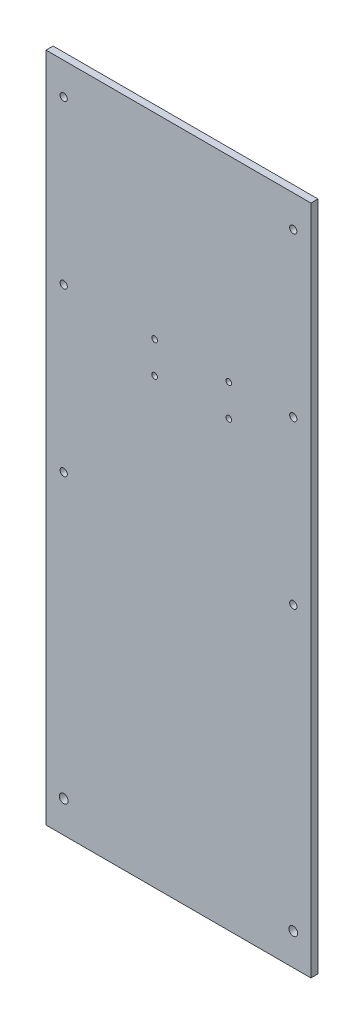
ISO-10303-21;
HEADER;
FILE_DESCRIPTION(('STEP AP214'),'2;1');
FILE_NAME('part.step','',(''),(''),'','','');
FILE_SCHEMA(('AUTOMOTIVE_DESIGN { 1 0 10303 214 1 1 1 1 }'));
ENDSEC;
DATA;
#1=APPLICATION_CONTEXT('core data for automotive mechanical design processes');
#2=APPLICATION_PROTOCOL_DEFINITION('international standard','automotive_design',2000,#1);
#3=PRODUCT_CONTEXT('',#1,'mechanical');
#4=PRODUCT('Part','Part','',(#3));
#5=PRODUCT_RELATED_PRODUCT_CATEGORY('part','',(#4));
#6=PRODUCT_DEFINITION_FORMATION('','',#4);
#7=PRODUCT_DEFINITION_CONTEXT('part definition',#1,'design');
#8=PRODUCT_DEFINITION('design','',#6,#7);
#9=PRODUCT_DEFINITION_SHAPE('','',#8);
#10=(LENGTH_UNIT() NAMED_UNIT(*) SI_UNIT(.MILLI.,.METRE.));
#11=(NAMED_UNIT(*) PLANE_ANGLE_UNIT() SI_UNIT($,.RADIAN.));
#12=(NAMED_UNIT(*) SI_UNIT($,.STERADIAN.) SOLID_ANGLE_UNIT());
#13=UNCERTAINTY_MEASURE_WITH_UNIT(LENGTH_MEASURE(1.E-05),#10,'distance_accuracy_value','');
#14=(GEOMETRIC_REPRESENTATION_CONTEXT(3) GLOBAL_UNCERTAINTY_ASSIGNED_CONTEXT((#13)) GLOBAL_UNIT_ASSIGNED_CONTEXT((#10,
#11,#12)) REPRESENTATION_CONTEXT('',''));
#15=CARTESIAN_POINT('',(0.,0.,0.));
#16=DIRECTION('',(0.,0.,1.));
#17=DIRECTION('',(1.,0.,0.));
#18=AXIS2_PLACEMENT_3D('',#15,#16,#17);
#19=CARTESIAN_POINT('',(75.,190.,4.));
#20=DIRECTION('',(-1.,0.,0.));
#21=DIRECTION('',(0.,-1.,0.));
#22=AXIS2_PLACEMENT_3D('',#19,#20,#21);
#23=PLANE('',#22);
#24=DIRECTION('',(0.,1.,0.));
#25=VECTOR('',#24,1.);
#26=CARTESIAN_POINT('',(75.,190.,0.));
#27=LINE('',#26,#25);
#28=CARTESIAN_POINT('',(75.,-190.,0.));
#29=VERTEX_POINT('',#28);
#30=CARTESIAN_POINT('',(75.,190.,0.));
#31=VERTEX_POINT('',#30);
#32=EDGE_CURVE('E97',#29,#31,#27,.T.);
#33=ORIENTED_EDGE('',*,*,#32,.T.);
#34=DIRECTION('',(0.,0.,-1.));
#35=VECTOR('',#34,1.);
#36=CARTESIAN_POINT('',(75.,190.,4.));
#37=LINE('',#36,#35);
#38=CARTESIAN_POINT('',(75.,190.,4.));
#39=VERTEX_POINT('',#38);
#40=EDGE_CURVE('E11',#39,#31,#37,.T.);
#41=ORIENTED_EDGE('',*,*,#40,.F.);
#42=DIRECTION('',(0.,1.,0.));
#43=VECTOR('',#42,1.);
#44=CARTESIAN_POINT('',(75.,190.,4.));
#45=LINE('',#44,#43);
#46=CARTESIAN_POINT('',(75.,-190.,4.));
#47=VERTEX_POINT('',#46);
#48=EDGE_CURVE('E85',#47,#39,#45,.T.);
#49=ORIENTED_EDGE('',*,*,#48,.F.);
#50=DIRECTION('',(0.,0.,-1.));
#51=VECTOR('',#50,1.);
#52=CARTESIAN_POINT('',(75.,-190.,4.));
#53=LINE('',#52,#51);
#54=EDGE_CURVE('E93',#47,#29,#53,.T.);
#55=ORIENTED_EDGE('',*,*,#54,.T.);
#56=EDGE_LOOP('',(#33,#41,#49,#55));
#57=FACE_BOUND('',#56,.T.);
#58=ADVANCED_FACE('F34',(#57),#23,.F.);
#59=CARTESIAN_POINT('',(-75.,190.,4.));
#60=DIRECTION('',(0.,-1.,0.));
#61=DIRECTION('',(0.,0.,-1.));
#62=AXIS2_PLACEMENT_3D('',#59,#60,#61);
#63=PLANE('',#62);
#64=DIRECTION('',(-1.,0.,0.));
#65=VECTOR('',#64,1.);
#66=CARTESIAN_POINT('',(-75.,190.,0.));
#67=LINE('',#66,#65);
#68=CARTESIAN_POINT('',(-75.,190.,0.));
#69=VERTEX_POINT('',#68);
#70=EDGE_CURVE('E89',#31,#69,#67,.T.);
#71=ORIENTED_EDGE('',*,*,#70,.T.);
#72=DIRECTION('',(0.,0.,-1.));
#73=VECTOR('',#72,1.);
#74=CARTESIAN_POINT('',(-75.,190.,4.));
#75=LINE('',#74,#73);
#76=CARTESIAN_POINT('',(-75.,190.,4.));
#77=VERTEX_POINT('',#76);
#78=EDGE_CURVE('E42',#77,#69,#75,.T.);
#79=ORIENTED_EDGE('',*,*,#78,.F.);
#80=DIRECTION('',(-1.,0.,0.));
#81=VECTOR('',#80,1.);
#82=CARTESIAN_POINT('',(-75.,190.,4.));
#83=LINE('',#82,#81);
#84=EDGE_CURVE('E80',#39,#77,#83,.T.);
#85=ORIENTED_EDGE('',*,*,#84,.F.);
#86=ORIENTED_EDGE('',*,*,#40,.T.);
#87=EDGE_LOOP('',(#71,#79,#85,#86));
#88=FACE_BOUND('',#87,.T.);
#89=ADVANCED_FACE('F88',(#88),#63,.F.);
#90=CARTESIAN_POINT('',(-75.,190.,4.));
#91=DIRECTION('',(1.,0.,0.));
#92=DIRECTION('',(0.,1.,0.));
#93=AXIS2_PLACEMENT_3D('',#90,#91,#92);
#94=PLANE('',#93);
#95=DIRECTION('',(0.,-1.,0.));
#96=VECTOR('',#95,1.);
#97=CARTESIAN_POINT('',(-75.,190.,0.));
#98=LINE('',#97,#96);
#99=CARTESIAN_POINT('',(-75.,-190.,0.));
#100=VERTEX_POINT('',#99);
#101=EDGE_CURVE('E67',#69,#100,#98,.T.);
#102=ORIENTED_EDGE('',*,*,#101,.T.);
#103=DIRECTION('',(0.,0.,-1.));
#104=VECTOR('',#103,1.);
#105=CARTESIAN_POINT('',(-75.,-190.,4.));
#106=LINE('',#105,#104);
#107=CARTESIAN_POINT('',(-75.,-190.,4.));
#108=VERTEX_POINT('',#107);
#109=EDGE_CURVE('E90',#108,#100,#106,.T.);
#110=ORIENTED_EDGE('',*,*,#109,.F.);
#111=DIRECTION('',(0.,-1.,0.));
#112=VECTOR('',#111,1.);
#113=CARTESIAN_POINT('',(-75.,190.,4.));
#114=LINE('',#113,#112);
#115=EDGE_CURVE('E83',#77,#108,#114,.T.);
#116=ORIENTED_EDGE('',*,*,#115,.F.);
#117=ORIENTED_EDGE('',*,*,#78,.T.);
#118=EDGE_LOOP('',(#102,#110,#116,#117));
#119=FACE_BOUND('',#118,.T.);
#120=ADVANCED_FACE('F91',(#119),#94,.F.);
#121=CARTESIAN_POINT('',(-75.,-190.,4.));
#122=DIRECTION('',(0.,1.,0.));
#123=DIRECTION('',(0.,0.,1.));
#124=AXIS2_PLACEMENT_3D('',#121,#122,#123);
#125=PLANE('',#124);
#126=DIRECTION('',(1.,0.,0.));
#127=VECTOR('',#126,1.);
#128=CARTESIAN_POINT('',(-75.,-190.,0.));
#129=LINE('',#128,#127);
#130=EDGE_CURVE('E73',#100,#29,#129,.T.);
#131=ORIENTED_EDGE('',*,*,#130,.T.);
#132=ORIENTED_EDGE('',*,*,#54,.F.);
#133=DIRECTION('',(1.,0.,0.));
#134=VECTOR('',#133,1.);
#135=CARTESIAN_POINT('',(-75.,-190.,4.));
#136=LINE('',#135,#134);
#137=EDGE_CURVE('E50',#108,#47,#136,.T.);
#138=ORIENTED_EDGE('',*,*,#137,.F.);
#139=ORIENTED_EDGE('',*,*,#109,.T.);
#140=EDGE_LOOP('',(#131,#132,#138,#139));
#141=FACE_BOUND('',#140,.T.);
#142=ADVANCED_FACE('F105',(#141),#125,.F.);
#143=CARTESIAN_POINT('',(0.,0.,4.));
#144=DIRECTION('',(0.,0.,1.));
#145=DIRECTION('',(1.,0.,0.));
#146=AXIS2_PLACEMENT_3D('',#143,#144,#145);
#147=PLANE('',#146);
#148=CARTESIAN_POINT('',(-65.0000000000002,-172.,4.));
#149=DIRECTION('',(0.,0.,-1.));
#150=DIRECTION('',(1.,0.,0.));
#151=AXIS2_PLACEMENT_3D('',#148,#149,#150);
#152=CIRCLE('',#151,2.50000000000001);
#153=CARTESIAN_POINT('',(-62.5000000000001,-172.,4.));
#154=VERTEX_POINT('',#153);
#155=EDGE_CURVE('E145',#154,#154,#152,.T.);
#156=ORIENTED_EDGE('',*,*,#155,.T.);
#157=EDGE_LOOP('',(#156));
#158=FACE_BOUND('',#157,.T.);
#159=CARTESIAN_POINT('',(64.9999999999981,-12.0000000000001,4.));
#160=DIRECTION('',(0.,0.,-1.));
#161=DIRECTION('',(-1.,0.,0.));
#162=AXIS2_PLACEMENT_3D('',#159,#160,#161);
#163=CIRCLE('',#162,2.04999999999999);
#164=CARTESIAN_POINT('',(62.9499999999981,-12.0000000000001,4.));
#165=VERTEX_POINT('',#164);
#166=EDGE_CURVE('E162',#165,#165,#163,.T.);
#167=ORIENTED_EDGE('',*,*,#166,.T.);
#168=EDGE_LOOP('',(#167));
#169=FACE_BOUND('',#168,.T.);
#170=CARTESIAN_POINT('',(-65.0000000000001,172.,4.));
#171=DIRECTION('',(0.,0.,-1.));
#172=DIRECTION('',(1.,0.,0.));
#173=AXIS2_PLACEMENT_3D('',#170,#171,#172);
#174=CIRCLE('',#173,2.04999999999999);
#175=CARTESIAN_POINT('',(-62.9500000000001,172.,4.));
#176=VERTEX_POINT('',#175);
#177=EDGE_CURVE('E163',#176,#176,#174,.T.);
#178=ORIENTED_EDGE('',*,*,#177,.T.);
#179=EDGE_LOOP('',(#178));
#180=FACE_BOUND('',#179,.T.);
#181=CARTESIAN_POINT('',(-65.000000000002,-12.,4.));
#182=DIRECTION('',(0.,0.,-1.));
#183=DIRECTION('',(1.,0.,0.));
#184=AXIS2_PLACEMENT_3D('',#181,#182,#183);
#185=CIRCLE('',#184,2.04999999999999);
#186=CARTESIAN_POINT('',(-62.950000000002,-12.,4.));
#187=VERTEX_POINT('',#186);
#188=EDGE_CURVE('E174',#187,#187,#185,.T.);
#189=ORIENTED_EDGE('',*,*,#188,.T.);
#190=EDGE_LOOP('',(#189));
#191=FACE_BOUND('',#190,.T.);
#192=CARTESIAN_POINT('',(-65.000000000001,80.,4.));
#193=DIRECTION('',(0.,0.,-1.));
#194=DIRECTION('',(1.,0.,0.));
#195=AXIS2_PLACEMENT_3D('',#192,#193,#194);
#196=CIRCLE('',#195,2.04999999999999);
#197=CARTESIAN_POINT('',(-62.950000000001,80.,4.));
#198=VERTEX_POINT('',#197);
#199=EDGE_CURVE('E144',#198,#198,#196,.T.);
#200=ORIENTED_EDGE('',*,*,#199,.T.);
#201=EDGE_LOOP('',(#200));
#202=FACE_BOUND('',#201,.T.);
#203=CARTESIAN_POINT('',(64.9999999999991,79.9999999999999,4.));
#204=DIRECTION('',(0.,0.,-1.));
#205=DIRECTION('',(-1.,0.,0.));
#206=AXIS2_PLACEMENT_3D('',#203,#204,#205);
#207=CIRCLE('',#206,2.04999999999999);
#208=CARTESIAN_POINT('',(62.9499999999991,79.9999999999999,4.));
#209=VERTEX_POINT('',#208);
#210=EDGE_CURVE('E151',#209,#209,#207,.T.);
#211=ORIENTED_EDGE('',*,*,#210,.T.);
#212=EDGE_LOOP('',(#211));
#213=FACE_BOUND('',#212,.T.);
#214=CARTESIAN_POINT('',(65.,-172.,4.));
#215=DIRECTION('',(0.,0.,-1.));
#216=DIRECTION('',(-1.,0.,0.));
#217=AXIS2_PLACEMENT_3D('',#214,#215,#216);
#218=CIRCLE('',#217,2.50000000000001);
#219=CARTESIAN_POINT('',(62.5,-172.,4.));
#220=VERTEX_POINT('',#219);
#221=EDGE_CURVE('E138',#220,#220,#218,.T.);
#222=ORIENTED_EDGE('',*,*,#221,.T.);
#223=EDGE_LOOP('',(#222));
#224=FACE_BOUND('',#223,.T.);
#225=CARTESIAN_POINT('',(65.,172.,4.));
#226=DIRECTION('',(0.,0.,-1.));
#227=DIRECTION('',(-1.,0.,0.));
#228=AXIS2_PLACEMENT_3D('',#225,#226,#227);
#229=CIRCLE('',#228,2.04999999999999);
#230=CARTESIAN_POINT('',(62.95,172.,4.));
#231=VERTEX_POINT('',#230);
#232=EDGE_CURVE('E130',#231,#231,#229,.T.);
#233=ORIENTED_EDGE('',*,*,#232,.T.);
#234=EDGE_LOOP('',(#233));
#235=FACE_BOUND('',#234,.T.);
#236=CARTESIAN_POINT('',(-13.4999999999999,61.0000000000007,4.));
#237=DIRECTION('',(0.,0.,1.));
#238=DIRECTION('',(1.,0.,0.));
#239=AXIS2_PLACEMENT_3D('',#236,#237,#238);
#240=CIRCLE('',#239,1.60000000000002);
#241=CARTESIAN_POINT('',(-11.8999999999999,61.0000000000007,4.));
#242=VERTEX_POINT('',#241);
#243=EDGE_CURVE('E116',#242,#242,#240,.T.);
#244=ORIENTED_EDGE('',*,*,#243,.F.);
#245=EDGE_LOOP('',(#244));
#246=FACE_BOUND('',#245,.T.);
#247=CARTESIAN_POINT('',(-13.4999999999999,79.0000000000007,4.));
#248=DIRECTION('',(0.,0.,1.));
#249=DIRECTION('',(1.,0.,0.));
#250=AXIS2_PLACEMENT_3D('',#247,#248,#249);
#251=CIRCLE('',#250,1.60000000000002);
#252=CARTESIAN_POINT('',(-11.8999999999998,79.0000000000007,4.));
#253=VERTEX_POINT('',#252);
#254=EDGE_CURVE('E119',#253,#253,#251,.T.);
#255=ORIENTED_EDGE('',*,*,#254,.F.);
#256=EDGE_LOOP('',(#255));
#257=FACE_BOUND('',#256,.T.);
#258=CARTESIAN_POINT('',(28.5000000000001,79.0000000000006,4.));
#259=DIRECTION('',(0.,0.,1.));
#260=DIRECTION('',(1.,0.,0.));
#261=AXIS2_PLACEMENT_3D('',#258,#259,#260);
#262=CIRCLE('',#261,1.60000000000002);
#263=CARTESIAN_POINT('',(30.1000000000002,79.0000000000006,4.));
#264=VERTEX_POINT('',#263);
#265=EDGE_CURVE('E122',#264,#264,#262,.T.);
#266=ORIENTED_EDGE('',*,*,#265,.F.);
#267=EDGE_LOOP('',(#266));
#268=FACE_BOUND('',#267,.T.);
#269=CARTESIAN_POINT('',(28.5000000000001,61.0000000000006,4.));
#270=DIRECTION('',(0.,0.,1.));
#271=DIRECTION('',(1.,0.,0.));
#272=AXIS2_PLACEMENT_3D('',#269,#270,#271);
#273=CIRCLE('',#272,1.60000000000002);
#274=CARTESIAN_POINT('',(30.1000000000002,61.0000000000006,4.));
#275=VERTEX_POINT('',#274);
#276=EDGE_CURVE('E100',#275,#275,#273,.T.);
#277=ORIENTED_EDGE('',*,*,#276,.F.);
#278=EDGE_LOOP('',(#277));
#279=FACE_BOUND('',#278,.T.);
#280=ORIENTED_EDGE('',*,*,#48,.T.);
#281=ORIENTED_EDGE('',*,*,#84,.T.);
#282=ORIENTED_EDGE('',*,*,#115,.T.);
#283=ORIENTED_EDGE('',*,*,#137,.T.);
#284=EDGE_LOOP('',(#280,#281,#282,#283));
#285=FACE_BOUND('',#284,.T.);
#286=ADVANCED_FACE('F81',(#158,#169,#180,#191,#202,#213,#224,#235,#246,#257,#268,#279,#285),
#147,.T.);
#287=CARTESIAN_POINT('',(0.,0.,0.));
#288=DIRECTION('',(0.,0.,1.));
#289=DIRECTION('',(1.,0.,0.));
#290=AXIS2_PLACEMENT_3D('',#287,#288,#289);
#291=PLANE('',#290);
#292=CARTESIAN_POINT('',(-65.0000000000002,-172.,0.));
#293=DIRECTION('',(0.,0.,-1.));
#294=DIRECTION('',(1.,0.,0.));
#295=AXIS2_PLACEMENT_3D('',#292,#293,#294);
#296=CIRCLE('',#295,2.50000000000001);
#297=CARTESIAN_POINT('',(-62.5000000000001,-172.,0.));
#298=VERTEX_POINT('',#297);
#299=EDGE_CURVE('E166',#298,#298,#296,.T.);
#300=ORIENTED_EDGE('',*,*,#299,.F.);
#301=EDGE_LOOP('',(#300));
#302=FACE_BOUND('',#301,.T.);
#303=CARTESIAN_POINT('',(64.9999999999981,-12.0000000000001,0.));
#304=DIRECTION('',(0.,0.,-1.));
#305=DIRECTION('',(-1.,0.,0.));
#306=AXIS2_PLACEMENT_3D('',#303,#304,#305);
#307=CIRCLE('',#306,2.04999999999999);
#308=CARTESIAN_POINT('',(62.9499999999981,-12.0000000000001,0.));
#309=VERTEX_POINT('',#308);
#310=EDGE_CURVE('E159',#309,#309,#307,.T.);
#311=ORIENTED_EDGE('',*,*,#310,.F.);
#312=EDGE_LOOP('',(#311));
#313=FACE_BOUND('',#312,.T.);
#314=CARTESIAN_POINT('',(-65.0000000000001,172.,0.));
#315=DIRECTION('',(0.,0.,-1.));
#316=DIRECTION('',(1.,0.,0.));
#317=AXIS2_PLACEMENT_3D('',#314,#315,#316);
#318=CIRCLE('',#317,2.04999999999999);
#319=CARTESIAN_POINT('',(-62.9500000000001,172.,0.));
#320=VERTEX_POINT('',#319);
#321=EDGE_CURVE('E177',#320,#320,#318,.T.);
#322=ORIENTED_EDGE('',*,*,#321,.F.);
#323=EDGE_LOOP('',(#322));
#324=FACE_BOUND('',#323,.T.);
#325=CARTESIAN_POINT('',(-65.000000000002,-12.,0.));
#326=DIRECTION('',(0.,0.,-1.));
#327=DIRECTION('',(1.,0.,0.));
#328=AXIS2_PLACEMENT_3D('',#325,#326,#327);
#329=CIRCLE('',#328,2.04999999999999);
#330=CARTESIAN_POINT('',(-62.950000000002,-12.,0.));
#331=VERTEX_POINT('',#330);
#332=EDGE_CURVE('E171',#331,#331,#329,.T.);
#333=ORIENTED_EDGE('',*,*,#332,.F.);
#334=EDGE_LOOP('',(#333));
#335=FACE_BOUND('',#334,.T.);
#336=CARTESIAN_POINT('',(-65.000000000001,80.,0.));
#337=DIRECTION('',(0.,0.,-1.));
#338=DIRECTION('',(1.,0.,0.));
#339=AXIS2_PLACEMENT_3D('',#336,#337,#338);
#340=CIRCLE('',#339,2.04999999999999);
#341=CARTESIAN_POINT('',(-62.950000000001,80.,0.));
#342=VERTEX_POINT('',#341);
#343=EDGE_CURVE('E141',#342,#342,#340,.T.);
#344=ORIENTED_EDGE('',*,*,#343,.F.);
#345=EDGE_LOOP('',(#344));
#346=FACE_BOUND('',#345,.T.);
#347=CARTESIAN_POINT('',(64.9999999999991,79.9999999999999,0.));
#348=DIRECTION('',(0.,0.,-1.));
#349=DIRECTION('',(-1.,0.,0.));
#350=AXIS2_PLACEMENT_3D('',#347,#348,#349);
#351=CIRCLE('',#350,2.04999999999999);
#352=CARTESIAN_POINT('',(62.9499999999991,79.9999999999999,0.));
#353=VERTEX_POINT('',#352);
#354=EDGE_CURVE('E148',#353,#353,#351,.T.);
#355=ORIENTED_EDGE('',*,*,#354,.F.);
#356=EDGE_LOOP('',(#355));
#357=FACE_BOUND('',#356,.T.);
#358=CARTESIAN_POINT('',(65.,-172.,0.));
#359=DIRECTION('',(0.,0.,-1.));
#360=DIRECTION('',(-1.,0.,0.));
#361=AXIS2_PLACEMENT_3D('',#358,#359,#360);
#362=CIRCLE('',#361,2.50000000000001);
#363=CARTESIAN_POINT('',(62.5,-172.,0.));
#364=VERTEX_POINT('',#363);
#365=EDGE_CURVE('E154',#364,#364,#362,.T.);
#366=ORIENTED_EDGE('',*,*,#365,.F.);
#367=EDGE_LOOP('',(#366));
#368=FACE_BOUND('',#367,.T.);
#369=CARTESIAN_POINT('',(65.,172.,0.));
#370=DIRECTION('',(0.,0.,-1.));
#371=DIRECTION('',(-1.,0.,0.));
#372=AXIS2_PLACEMENT_3D('',#369,#370,#371);
#373=CIRCLE('',#372,2.04999999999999);
#374=CARTESIAN_POINT('',(62.95,172.,0.));
#375=VERTEX_POINT('',#374);
#376=EDGE_CURVE('E135',#375,#375,#373,.T.);
#377=ORIENTED_EDGE('',*,*,#376,.F.);
#378=EDGE_LOOP('',(#377));
#379=FACE_BOUND('',#378,.T.);
#380=CARTESIAN_POINT('',(-13.4999999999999,61.0000000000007,0.));
#381=DIRECTION('',(0.,0.,-1.));
#382=DIRECTION('',(-1.,0.,0.));
#383=AXIS2_PLACEMENT_3D('',#380,#381,#382);
#384=CIRCLE('',#383,1.60000000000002);
#385=CARTESIAN_POINT('',(-15.0999999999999,61.0000000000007,0.));
#386=VERTEX_POINT('',#385);
#387=EDGE_CURVE('E125',#386,#386,#384,.T.);
#388=ORIENTED_EDGE('',*,*,#387,.F.);
#389=EDGE_LOOP('',(#388));
#390=FACE_BOUND('',#389,.T.);
#391=CARTESIAN_POINT('',(-13.4999999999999,79.0000000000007,0.));
#392=DIRECTION('',(0.,0.,-1.));
#393=DIRECTION('',(-1.,0.,0.));
#394=AXIS2_PLACEMENT_3D('',#391,#392,#393);
#395=CIRCLE('',#394,1.60000000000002);
#396=CARTESIAN_POINT('',(-15.0999999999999,79.0000000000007,0.));
#397=VERTEX_POINT('',#396);
#398=EDGE_CURVE('E129',#397,#397,#395,.T.);
#399=ORIENTED_EDGE('',*,*,#398,.F.);
#400=EDGE_LOOP('',(#399));
#401=FACE_BOUND('',#400,.T.);
#402=CARTESIAN_POINT('',(28.5000000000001,79.0000000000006,0.));
#403=DIRECTION('',(0.,0.,-1.));
#404=DIRECTION('',(-1.,0.,0.));
#405=AXIS2_PLACEMENT_3D('',#402,#403,#404);
#406=CIRCLE('',#405,1.60000000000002);
#407=CARTESIAN_POINT('',(26.9000000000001,79.0000000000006,0.));
#408=VERTEX_POINT('',#407);
#409=EDGE_CURVE('E126',#408,#408,#406,.T.);
#410=ORIENTED_EDGE('',*,*,#409,.F.);
#411=EDGE_LOOP('',(#410));
#412=FACE_BOUND('',#411,.T.);
#413=CARTESIAN_POINT('',(28.5000000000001,61.0000000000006,0.));
#414=DIRECTION('',(0.,0.,-1.));
#415=DIRECTION('',(-1.,0.,0.));
#416=AXIS2_PLACEMENT_3D('',#413,#414,#415);
#417=CIRCLE('',#416,1.60000000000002);
#418=CARTESIAN_POINT('',(26.9000000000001,61.0000000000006,0.));
#419=VERTEX_POINT('',#418);
#420=EDGE_CURVE('E113',#419,#419,#417,.T.);
#421=ORIENTED_EDGE('',*,*,#420,.F.);
#422=EDGE_LOOP('',(#421));
#423=FACE_BOUND('',#422,.T.);
#424=ORIENTED_EDGE('',*,*,#32,.F.);
#425=ORIENTED_EDGE('',*,*,#130,.F.);
#426=ORIENTED_EDGE('',*,*,#101,.F.);
#427=ORIENTED_EDGE('',*,*,#70,.F.);
#428=EDGE_LOOP('',(#424,#425,#426,#427));
#429=FACE_BOUND('',#428,.T.);
#430=ADVANCED_FACE('F108',(#302,#313,#324,#335,#346,#357,#368,#379,#390,#401,#412,#423,#429),
#291,.F.);
#431=CARTESIAN_POINT('',(28.5000000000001,61.0000000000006,10.));
#432=DIRECTION('',(0.,0.,-1.));
#433=DIRECTION('',(-1.,0.,0.));
#434=AXIS2_PLACEMENT_3D('',#431,#432,#433);
#435=CYLINDRICAL_SURFACE('',#434,1.60000000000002);
#436=ORIENTED_EDGE('',*,*,#276,.T.);
#437=EDGE_LOOP('',(#436));
#438=FACE_BOUND('',#437,.T.);
#439=ORIENTED_EDGE('',*,*,#420,.T.);
#440=EDGE_LOOP('',(#439));
#441=FACE_BOUND('',#440,.T.);
#442=ADVANCED_FACE('F195',(#438,#441),#435,.F.);
#443=CARTESIAN_POINT('',(28.5000000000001,79.0000000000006,10.));
#444=DIRECTION('',(0.,0.,-1.));
#445=DIRECTION('',(-1.,0.,0.));
#446=AXIS2_PLACEMENT_3D('',#443,#444,#445);
#447=CYLINDRICAL_SURFACE('',#446,1.60000000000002);
#448=ORIENTED_EDGE('',*,*,#265,.T.);
#449=EDGE_LOOP('',(#448));
#450=FACE_BOUND('',#449,.T.);
#451=ORIENTED_EDGE('',*,*,#409,.T.);
#452=EDGE_LOOP('',(#451));
#453=FACE_BOUND('',#452,.T.);
#454=ADVANCED_FACE('F217',(#450,#453),#447,.F.);
#455=CARTESIAN_POINT('',(-13.4999999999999,79.0000000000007,10.));
#456=DIRECTION('',(0.,0.,-1.));
#457=DIRECTION('',(-1.,0.,0.));
#458=AXIS2_PLACEMENT_3D('',#455,#456,#457);
#459=CYLINDRICAL_SURFACE('',#458,1.60000000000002);
#460=ORIENTED_EDGE('',*,*,#254,.T.);
#461=EDGE_LOOP('',(#460));
#462=FACE_BOUND('',#461,.T.);
#463=ORIENTED_EDGE('',*,*,#398,.T.);
#464=EDGE_LOOP('',(#463));
#465=FACE_BOUND('',#464,.T.);
#466=ADVANCED_FACE('F223',(#462,#465),#459,.F.);
#467=CARTESIAN_POINT('',(-13.4999999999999,61.0000000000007,10.));
#468=DIRECTION('',(0.,0.,-1.));
#469=DIRECTION('',(-1.,0.,0.));
#470=AXIS2_PLACEMENT_3D('',#467,#468,#469);
#471=CYLINDRICAL_SURFACE('',#470,1.60000000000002);
#472=ORIENTED_EDGE('',*,*,#243,.T.);
#473=EDGE_LOOP('',(#472));
#474=FACE_BOUND('',#473,.T.);
#475=ORIENTED_EDGE('',*,*,#387,.T.);
#476=EDGE_LOOP('',(#475));
#477=FACE_BOUND('',#476,.T.);
#478=ADVANCED_FACE('F273',(#474,#477),#471,.F.);
#479=CARTESIAN_POINT('',(65.,172.,4.));
#480=DIRECTION('',(0.,0.,-1.));
#481=DIRECTION('',(-1.,0.,0.));
#482=AXIS2_PLACEMENT_3D('',#479,#480,#481);
#483=CYLINDRICAL_SURFACE('',#482,2.04999999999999);
#484=ORIENTED_EDGE('',*,*,#232,.F.);
#485=EDGE_LOOP('',(#484));
#486=FACE_BOUND('',#485,.T.);
#487=ORIENTED_EDGE('',*,*,#376,.T.);
#488=EDGE_LOOP('',(#487));
#489=FACE_BOUND('',#488,.T.);
#490=ADVANCED_FACE('F262',(#486,#489),#483,.F.);
#491=CARTESIAN_POINT('',(65.,-172.,4.));
#492=DIRECTION('',(0.,0.,-1.));
#493=DIRECTION('',(-1.,0.,0.));
#494=AXIS2_PLACEMENT_3D('',#491,#492,#493);
#495=CYLINDRICAL_SURFACE('',#494,2.50000000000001);
#496=ORIENTED_EDGE('',*,*,#221,.F.);
#497=EDGE_LOOP('',(#496));
#498=FACE_BOUND('',#497,.T.);
#499=ORIENTED_EDGE('',*,*,#365,.T.);
#500=EDGE_LOOP('',(#499));
#501=FACE_BOUND('',#500,.T.);
#502=ADVANCED_FACE('F258',(#498,#501),#495,.F.);
#503=CARTESIAN_POINT('',(64.9999999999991,79.9999999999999,4.));
#504=DIRECTION('',(0.,0.,-1.));
#505=DIRECTION('',(-1.,0.,0.));
#506=AXIS2_PLACEMENT_3D('',#503,#504,#505);
#507=CYLINDRICAL_SURFACE('',#506,2.04999999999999);
#508=ORIENTED_EDGE('',*,*,#210,.F.);
#509=EDGE_LOOP('',(#508));
#510=FACE_BOUND('',#509,.T.);
#511=ORIENTED_EDGE('',*,*,#354,.T.);
#512=EDGE_LOOP('',(#511));
#513=FACE_BOUND('',#512,.T.);
#514=ADVANCED_FACE('F261',(#510,#513),#507,.F.);
#515=CARTESIAN_POINT('',(-65.000000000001,80.,4.));
#516=DIRECTION('',(0.,0.,-1.));
#517=DIRECTION('',(-1.,0.,0.));
#518=AXIS2_PLACEMENT_3D('',#515,#516,#517);
#519=CYLINDRICAL_SURFACE('',#518,2.04999999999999);
#520=ORIENTED_EDGE('',*,*,#199,.F.);
#521=EDGE_LOOP('',(#520));
#522=FACE_BOUND('',#521,.T.);
#523=ORIENTED_EDGE('',*,*,#343,.T.);
#524=EDGE_LOOP('',(#523));
#525=FACE_BOUND('',#524,.T.);
#526=ADVANCED_FACE('F266',(#522,#525),#519,.F.);
#527=CARTESIAN_POINT('',(-65.000000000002,-12.,4.));
#528=DIRECTION('',(0.,0.,-1.));
#529=DIRECTION('',(-1.,0.,0.));
#530=AXIS2_PLACEMENT_3D('',#527,#528,#529);
#531=CYLINDRICAL_SURFACE('',#530,2.04999999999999);
#532=ORIENTED_EDGE('',*,*,#188,.F.);
#533=EDGE_LOOP('',(#532));
#534=FACE_BOUND('',#533,.T.);
#535=ORIENTED_EDGE('',*,*,#332,.T.);
#536=EDGE_LOOP('',(#535));
#537=FACE_BOUND('',#536,.T.);
#538=ADVANCED_FACE('F189',(#534,#537),#531,.F.);
#539=CARTESIAN_POINT('',(-65.0000000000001,172.,4.));
#540=DIRECTION('',(0.,0.,-1.));
#541=DIRECTION('',(-1.,0.,0.));
#542=AXIS2_PLACEMENT_3D('',#539,#540,#541);
#543=CYLINDRICAL_SURFACE('',#542,2.04999999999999);
#544=ORIENTED_EDGE('',*,*,#177,.F.);
#545=EDGE_LOOP('',(#544));
#546=FACE_BOUND('',#545,.T.);
#547=ORIENTED_EDGE('',*,*,#321,.T.);
#548=EDGE_LOOP('',(#547));
#549=FACE_BOUND('',#548,.T.);
#550=ADVANCED_FACE('F185',(#546,#549),#543,.F.);
#551=CARTESIAN_POINT('',(64.9999999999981,-12.0000000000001,4.));
#552=DIRECTION('',(0.,0.,-1.));
#553=DIRECTION('',(-1.,0.,0.));
#554=AXIS2_PLACEMENT_3D('',#551,#552,#553);
#555=CYLINDRICAL_SURFACE('',#554,2.04999999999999);
#556=ORIENTED_EDGE('',*,*,#166,.F.);
#557=EDGE_LOOP('',(#556));
#558=FACE_BOUND('',#557,.T.);
#559=ORIENTED_EDGE('',*,*,#310,.T.);
#560=EDGE_LOOP('',(#559));
#561=FACE_BOUND('',#560,.T.);
#562=ADVANCED_FACE('F188',(#558,#561),#555,.F.);
#563=CARTESIAN_POINT('',(-65.0000000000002,-172.,4.));
#564=DIRECTION('',(0.,0.,-1.));
#565=DIRECTION('',(-1.,0.,0.));
#566=AXIS2_PLACEMENT_3D('',#563,#564,#565);
#567=CYLINDRICAL_SURFACE('',#566,2.50000000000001);
#568=ORIENTED_EDGE('',*,*,#155,.F.);
#569=EDGE_LOOP('',(#568));
#570=FACE_BOUND('',#569,.T.);
#571=ORIENTED_EDGE('',*,*,#299,.T.);
#572=EDGE_LOOP('',(#571));
#573=FACE_BOUND('',#572,.T.);
#574=ADVANCED_FACE('F247',(#570,#573),#567,.F.);
#575=CLOSED_SHELL('',(#58,#89,#120,#142,#286,#430,#442,#454,#466,#478,#490,#502,#514,#526,#538,
#550,#562,#574));
#576=MANIFOLD_SOLID_BREP('B2',#575);
#577=ADVANCED_BREP_SHAPE_REPRESENTATION('',(#18,#576),#14);
#578=SHAPE_DEFINITION_REPRESENTATION(#9,#577);
ENDSEC;
END-ISO-10303-21;
